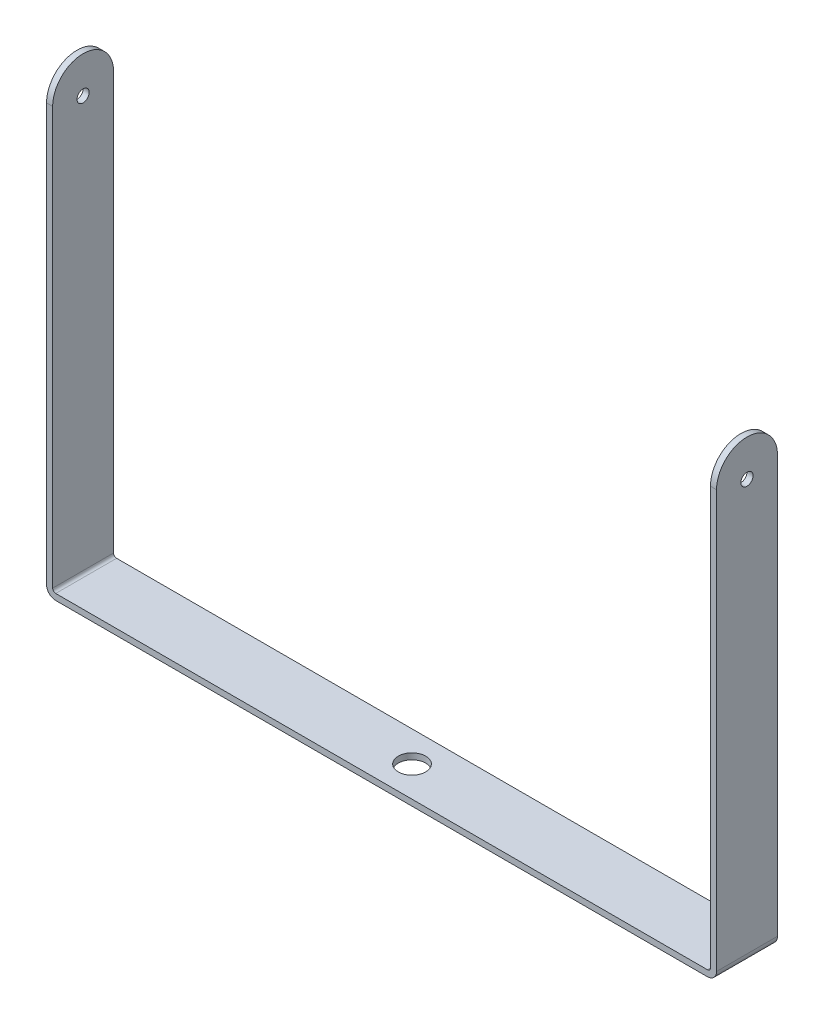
ISO-10303-21;
HEADER;
FILE_DESCRIPTION(('STEP AP214'),'2;1');
FILE_NAME('part.step','',(''),(''),'','','');
FILE_SCHEMA(('AUTOMOTIVE_DESIGN { 1 0 10303 214 1 1 1 1 }'));
ENDSEC;
DATA;
#1=APPLICATION_CONTEXT('core data for automotive mechanical design processes');
#2=APPLICATION_PROTOCOL_DEFINITION('international standard','automotive_design',2000,#1);
#3=PRODUCT_CONTEXT('',#1,'mechanical');
#4=PRODUCT('Part','Part','',(#3));
#5=PRODUCT_RELATED_PRODUCT_CATEGORY('part','',(#4));
#6=PRODUCT_DEFINITION_FORMATION('','',#4);
#7=PRODUCT_DEFINITION_CONTEXT('part definition',#1,'design');
#8=PRODUCT_DEFINITION('design','',#6,#7);
#9=PRODUCT_DEFINITION_SHAPE('','',#8);
#10=(LENGTH_UNIT() NAMED_UNIT(*) SI_UNIT(.MILLI.,.METRE.));
#11=(NAMED_UNIT(*) PLANE_ANGLE_UNIT() SI_UNIT($,.RADIAN.));
#12=(NAMED_UNIT(*) SI_UNIT($,.STERADIAN.) SOLID_ANGLE_UNIT());
#13=UNCERTAINTY_MEASURE_WITH_UNIT(LENGTH_MEASURE(1.E-05),#10,'distance_accuracy_value','');
#14=(GEOMETRIC_REPRESENTATION_CONTEXT(3) GLOBAL_UNCERTAINTY_ASSIGNED_CONTEXT((#13)) GLOBAL_UNIT_ASSIGNED_CONTEXT((#10,
#11,#12)) REPRESENTATION_CONTEXT('',''));
#15=CARTESIAN_POINT('',(0.,0.,0.));
#16=DIRECTION('',(0.,0.,1.));
#17=DIRECTION('',(1.,0.,0.));
#18=AXIS2_PLACEMENT_3D('',#15,#16,#17);
#19=CARTESIAN_POINT('',(-110.,2.,10.));
#20=DIRECTION('',(1.,0.,0.));
#21=DIRECTION('',(0.,1.,0.));
#22=AXIS2_PLACEMENT_3D('',#19,#20,#21);
#23=PLANE('',#22);
#24=CARTESIAN_POINT('',(-110.,0.,0.));
#25=DIRECTION('',(-1.,0.,0.));
#26=DIRECTION('',(0.,-1.,0.));
#27=AXIS2_PLACEMENT_3D('',#24,#25,#26);
#28=CIRCLE('',#27,2.);
#29=CARTESIAN_POINT('',(-110.,-2.00000000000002,0.));
#30=VERTEX_POINT('',#29);
#31=EDGE_CURVE('E316',#30,#30,#28,.T.);
#32=ORIENTED_EDGE('',*,*,#31,.F.);
#33=EDGE_LOOP('',(#32));
#34=FACE_BOUND('',#33,.T.);
#35=DIRECTION('',(0.,-1.,0.));
#36=VECTOR('',#35,1.);
#37=CARTESIAN_POINT('',(-110.,2.,-10.));
#38=LINE('',#37,#36);
#39=CARTESIAN_POINT('',(-110.,2.,-10.));
#40=VERTEX_POINT('',#39);
#41=CARTESIAN_POINT('',(-110.,-135.,-10.));
#42=VERTEX_POINT('',#41);
#43=EDGE_CURVE('E122',#40,#42,#38,.T.);
#44=ORIENTED_EDGE('',*,*,#43,.T.);
#45=DIRECTION('',(0.,0.,-1.));
#46=VECTOR('',#45,1.);
#47=CARTESIAN_POINT('',(-110.,-135.,10.));
#48=LINE('',#47,#46);
#49=CARTESIAN_POINT('',(-110.,-135.,10.));
#50=VERTEX_POINT('',#49);
#51=EDGE_CURVE('E11',#50,#42,#48,.T.);
#52=ORIENTED_EDGE('',*,*,#51,.F.);
#53=DIRECTION('',(0.,-1.,0.));
#54=VECTOR('',#53,1.);
#55=CARTESIAN_POINT('',(-110.,2.,10.));
#56=LINE('',#55,#54);
#57=CARTESIAN_POINT('',(-110.,2.,10.));
#58=VERTEX_POINT('',#57);
#59=EDGE_CURVE('E142',#58,#50,#56,.T.);
#60=ORIENTED_EDGE('',*,*,#59,.F.);
#61=CARTESIAN_POINT('',(-110.,2.,0.));
#62=DIRECTION('',(1.,0.,0.));
#63=DIRECTION('',(0.,0.,-1.));
#64=AXIS2_PLACEMENT_3D('',#61,#62,#63);
#65=CIRCLE('',#64,10.);
#66=EDGE_CURVE('E138',#40,#58,#65,.T.);
#67=ORIENTED_EDGE('',*,*,#66,.F.);
#68=EDGE_LOOP('',(#44,#52,#60,#67));
#69=FACE_BOUND('',#68,.T.);
#70=ADVANCED_FACE('F33',(#34,#69),#23,.F.);
#71=CARTESIAN_POINT('',(-107.,-135.,10.));
#72=DIRECTION('',(0.,0.,-1.));
#73=DIRECTION('',(-1.,0.,0.));
#74=AXIS2_PLACEMENT_3D('',#71,#72,#73);
#75=CYLINDRICAL_SURFACE('',#74,3.);
#76=CARTESIAN_POINT('',(-107.,-135.,-10.));
#77=DIRECTION('',(0.,0.,1.));
#78=DIRECTION('',(1.,0.,0.));
#79=AXIS2_PLACEMENT_3D('',#76,#77,#78);
#80=CIRCLE('',#79,3.);
#81=CARTESIAN_POINT('',(-107.,-138.,-10.));
#82=VERTEX_POINT('',#81);
#83=EDGE_CURVE('E129',#42,#82,#80,.T.);
#84=ORIENTED_EDGE('',*,*,#83,.T.);
#85=DIRECTION('',(0.,0.,-1.));
#86=VECTOR('',#85,1.);
#87=CARTESIAN_POINT('',(-107.,-138.,10.));
#88=LINE('',#87,#86);
#89=CARTESIAN_POINT('',(-107.,-138.,10.));
#90=VERTEX_POINT('',#89);
#91=EDGE_CURVE('E41',#90,#82,#88,.T.);
#92=ORIENTED_EDGE('',*,*,#91,.F.);
#93=CARTESIAN_POINT('',(-107.,-135.,10.));
#94=DIRECTION('',(0.,0.,1.));
#95=DIRECTION('',(1.,0.,0.));
#96=AXIS2_PLACEMENT_3D('',#93,#94,#95);
#97=CIRCLE('',#96,3.);
#98=EDGE_CURVE('E184',#50,#90,#97,.T.);
#99=ORIENTED_EDGE('',*,*,#98,.F.);
#100=ORIENTED_EDGE('',*,*,#51,.T.);
#101=EDGE_LOOP('',(#84,#92,#99,#100));
#102=FACE_BOUND('',#101,.T.);
#103=ADVANCED_FACE('F263',(#102),#75,.T.);
#104=CARTESIAN_POINT('',(-107.,-138.,10.));
#105=DIRECTION('',(0.,1.,0.));
#106=DIRECTION('',(0.,0.,1.));
#107=AXIS2_PLACEMENT_3D('',#104,#105,#106);
#108=PLANE('',#107);
#109=CARTESIAN_POINT('',(0.,-138.,0.));
#110=DIRECTION('',(0.,1.,0.));
#111=DIRECTION('',(0.,0.,1.));
#112=AXIS2_PLACEMENT_3D('',#109,#110,#111);
#113=CIRCLE('',#112,4.5);
#114=CARTESIAN_POINT('',(0.,-138.,4.5));
#115=VERTEX_POINT('',#114);
#116=EDGE_CURVE('E140',#115,#115,#113,.T.);
#117=ORIENTED_EDGE('',*,*,#116,.T.);
#118=EDGE_LOOP('',(#117));
#119=FACE_BOUND('',#118,.T.);
#120=DIRECTION('',(1.,0.,0.));
#121=VECTOR('',#120,1.);
#122=CARTESIAN_POINT('',(-107.,-138.,-10.));
#123=LINE('',#122,#121);
#124=CARTESIAN_POINT('',(107.,-138.,-10.));
#125=VERTEX_POINT('',#124);
#126=EDGE_CURVE('E162',#82,#125,#123,.T.);
#127=ORIENTED_EDGE('',*,*,#126,.T.);
#128=DIRECTION('',(0.,0.,-1.));
#129=VECTOR('',#128,1.);
#130=CARTESIAN_POINT('',(107.,-138.,10.));
#131=LINE('',#130,#129);
#132=CARTESIAN_POINT('',(107.,-138.,10.));
#133=VERTEX_POINT('',#132);
#134=EDGE_CURVE('E217',#133,#125,#131,.T.);
#135=ORIENTED_EDGE('',*,*,#134,.F.);
#136=DIRECTION('',(1.,0.,0.));
#137=VECTOR('',#136,1.);
#138=CARTESIAN_POINT('',(-107.,-138.,10.));
#139=LINE('',#138,#137);
#140=EDGE_CURVE('E186',#90,#133,#139,.T.);
#141=ORIENTED_EDGE('',*,*,#140,.F.);
#142=ORIENTED_EDGE('',*,*,#91,.T.);
#143=EDGE_LOOP('',(#127,#135,#141,#142));
#144=FACE_BOUND('',#143,.T.);
#145=ADVANCED_FACE('F224',(#119,#144),#108,.F.);
#146=CARTESIAN_POINT('',(107.,-135.,10.));
#147=DIRECTION('',(0.,0.,-1.));
#148=DIRECTION('',(-1.,0.,0.));
#149=AXIS2_PLACEMENT_3D('',#146,#147,#148);
#150=CYLINDRICAL_SURFACE('',#149,3.);
#151=CARTESIAN_POINT('',(107.,-135.,-10.));
#152=DIRECTION('',(0.,0.,1.));
#153=DIRECTION('',(1.,0.,0.));
#154=AXIS2_PLACEMENT_3D('',#151,#152,#153);
#155=CIRCLE('',#154,3.);
#156=CARTESIAN_POINT('',(110.,-135.,-10.));
#157=VERTEX_POINT('',#156);
#158=EDGE_CURVE('E164',#125,#157,#155,.T.);
#159=ORIENTED_EDGE('',*,*,#158,.T.);
#160=DIRECTION('',(0.,0.,-1.));
#161=VECTOR('',#160,1.);
#162=CARTESIAN_POINT('',(110.,-135.,10.));
#163=LINE('',#162,#161);
#164=CARTESIAN_POINT('',(110.,-135.,10.));
#165=VERTEX_POINT('',#164);
#166=EDGE_CURVE('E214',#165,#157,#163,.T.);
#167=ORIENTED_EDGE('',*,*,#166,.F.);
#168=CARTESIAN_POINT('',(107.,-135.,10.));
#169=DIRECTION('',(0.,0.,1.));
#170=DIRECTION('',(1.,0.,0.));
#171=AXIS2_PLACEMENT_3D('',#168,#169,#170);
#172=CIRCLE('',#171,3.);
#173=EDGE_CURVE('E188',#133,#165,#172,.T.);
#174=ORIENTED_EDGE('',*,*,#173,.F.);
#175=ORIENTED_EDGE('',*,*,#134,.T.);
#176=EDGE_LOOP('',(#159,#167,#174,#175));
#177=FACE_BOUND('',#176,.T.);
#178=ADVANCED_FACE('F233',(#177),#150,.T.);
#179=CARTESIAN_POINT('',(110.,-135.,10.));
#180=DIRECTION('',(-1.,0.,0.));
#181=DIRECTION('',(0.,0.,1.));
#182=AXIS2_PLACEMENT_3D('',#179,#180,#181);
#183=PLANE('',#182);
#184=CARTESIAN_POINT('',(110.,0.,0.));
#185=DIRECTION('',(-1.,0.,0.));
#186=DIRECTION('',(0.,-1.,0.));
#187=AXIS2_PLACEMENT_3D('',#184,#185,#186);
#188=CIRCLE('',#187,2.);
#189=CARTESIAN_POINT('',(110.,-1.99999999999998,0.));
#190=VERTEX_POINT('',#189);
#191=EDGE_CURVE('E314',#190,#190,#188,.T.);
#192=ORIENTED_EDGE('',*,*,#191,.T.);
#193=EDGE_LOOP('',(#192));
#194=FACE_BOUND('',#193,.T.);
#195=DIRECTION('',(0.,1.,0.));
#196=VECTOR('',#195,1.);
#197=CARTESIAN_POINT('',(110.,-135.,-10.));
#198=LINE('',#197,#196);
#199=CARTESIAN_POINT('',(110.,2.,-10.));
#200=VERTEX_POINT('',#199);
#201=EDGE_CURVE('E166',#157,#200,#198,.T.);
#202=ORIENTED_EDGE('',*,*,#201,.T.);
#203=CARTESIAN_POINT('',(110.,2.,0.));
#204=DIRECTION('',(1.,0.,0.));
#205=DIRECTION('',(0.,0.,-1.));
#206=AXIS2_PLACEMENT_3D('',#203,#204,#205);
#207=CIRCLE('',#206,10.);
#208=CARTESIAN_POINT('',(110.,2.,10.));
#209=VERTEX_POINT('',#208);
#210=EDGE_CURVE('E145',#200,#209,#207,.T.);
#211=ORIENTED_EDGE('',*,*,#210,.T.);
#212=DIRECTION('',(0.,1.,0.));
#213=VECTOR('',#212,1.);
#214=CARTESIAN_POINT('',(110.,-135.,10.));
#215=LINE('',#214,#213);
#216=EDGE_CURVE('E190',#165,#209,#215,.T.);
#217=ORIENTED_EDGE('',*,*,#216,.F.);
#218=ORIENTED_EDGE('',*,*,#166,.T.);
#219=EDGE_LOOP('',(#202,#211,#217,#218));
#220=FACE_BOUND('',#219,.T.);
#221=ADVANCED_FACE('F237',(#194,#220),#183,.F.);
#222=CARTESIAN_POINT('',(108.,-135.,10.));
#223=DIRECTION('',(1.,0.,0.));
#224=DIRECTION('',(0.,0.,-1.));
#225=AXIS2_PLACEMENT_3D('',#222,#223,#224);
#226=PLANE('',#225);
#227=CARTESIAN_POINT('',(108.,0.,0.));
#228=DIRECTION('',(1.,0.,0.));
#229=DIRECTION('',(0.,0.,-1.));
#230=AXIS2_PLACEMENT_3D('',#227,#228,#229);
#231=CIRCLE('',#230,2.);
#232=CARTESIAN_POINT('',(108.,0.,-2.));
#233=VERTEX_POINT('',#232);
#234=EDGE_CURVE('E143',#233,#233,#231,.T.);
#235=ORIENTED_EDGE('',*,*,#234,.T.);
#236=EDGE_LOOP('',(#235));
#237=FACE_BOUND('',#236,.T.);
#238=DIRECTION('',(0.,-1.,0.));
#239=VECTOR('',#238,1.);
#240=CARTESIAN_POINT('',(108.,-135.,-10.));
#241=LINE('',#240,#239);
#242=CARTESIAN_POINT('',(108.,2.,-10.));
#243=VERTEX_POINT('',#242);
#244=CARTESIAN_POINT('',(108.,-135.,-10.));
#245=VERTEX_POINT('',#244);
#246=EDGE_CURVE('E171',#243,#245,#241,.T.);
#247=ORIENTED_EDGE('',*,*,#246,.T.);
#248=DIRECTION('',(0.,0.,-1.));
#249=VECTOR('',#248,1.);
#250=CARTESIAN_POINT('',(108.,-135.,10.));
#251=LINE('',#250,#249);
#252=CARTESIAN_POINT('',(108.,-135.,10.));
#253=VERTEX_POINT('',#252);
#254=EDGE_CURVE('E211',#253,#245,#251,.T.);
#255=ORIENTED_EDGE('',*,*,#254,.F.);
#256=DIRECTION('',(0.,-1.,0.));
#257=VECTOR('',#256,1.);
#258=CARTESIAN_POINT('',(108.,-135.,10.));
#259=LINE('',#258,#257);
#260=CARTESIAN_POINT('',(108.,2.,10.));
#261=VERTEX_POINT('',#260);
#262=EDGE_CURVE('E194',#261,#253,#259,.T.);
#263=ORIENTED_EDGE('',*,*,#262,.F.);
#264=CARTESIAN_POINT('',(108.,2.,0.));
#265=DIRECTION('',(1.,0.,0.));
#266=DIRECTION('',(0.,0.,-1.));
#267=AXIS2_PLACEMENT_3D('',#264,#265,#266);
#268=CIRCLE('',#267,10.);
#269=EDGE_CURVE('E153',#243,#261,#268,.T.);
#270=ORIENTED_EDGE('',*,*,#269,.F.);
#271=EDGE_LOOP('',(#247,#255,#263,#270));
#272=FACE_BOUND('',#271,.T.);
#273=ADVANCED_FACE('F246',(#237,#272),#226,.F.);
#274=CARTESIAN_POINT('',(107.,-135.,10.));
#275=DIRECTION('',(0.,0.,-1.));
#276=DIRECTION('',(-1.,0.,0.));
#277=AXIS2_PLACEMENT_3D('',#274,#275,#276);
#278=CYLINDRICAL_SURFACE('',#277,1.);
#279=CARTESIAN_POINT('',(107.,-135.,-10.));
#280=DIRECTION('',(0.,0.,-1.));
#281=DIRECTION('',(1.,0.,0.));
#282=AXIS2_PLACEMENT_3D('',#279,#280,#281);
#283=CIRCLE('',#282,1.);
#284=CARTESIAN_POINT('',(107.,-136.,-10.));
#285=VERTEX_POINT('',#284);
#286=EDGE_CURVE('E173',#245,#285,#283,.T.);
#287=ORIENTED_EDGE('',*,*,#286,.T.);
#288=DIRECTION('',(0.,0.,-1.));
#289=VECTOR('',#288,1.);
#290=CARTESIAN_POINT('',(107.,-136.,10.));
#291=LINE('',#290,#289);
#292=CARTESIAN_POINT('',(107.,-136.,10.));
#293=VERTEX_POINT('',#292);
#294=EDGE_CURVE('E208',#293,#285,#291,.T.);
#295=ORIENTED_EDGE('',*,*,#294,.F.);
#296=CARTESIAN_POINT('',(107.,-135.,10.));
#297=DIRECTION('',(0.,0.,-1.));
#298=DIRECTION('',(1.,0.,0.));
#299=AXIS2_PLACEMENT_3D('',#296,#297,#298);
#300=CIRCLE('',#299,1.);
#301=EDGE_CURVE('E196',#253,#293,#300,.T.);
#302=ORIENTED_EDGE('',*,*,#301,.F.);
#303=ORIENTED_EDGE('',*,*,#254,.T.);
#304=EDGE_LOOP('',(#287,#295,#302,#303));
#305=FACE_BOUND('',#304,.T.);
#306=ADVANCED_FACE('F253',(#305),#278,.F.);
#307=CARTESIAN_POINT('',(-107.,-136.,10.));
#308=DIRECTION('',(0.,-1.,0.));
#309=DIRECTION('',(0.,0.,-1.));
#310=AXIS2_PLACEMENT_3D('',#307,#308,#309);
#311=PLANE('',#310);
#312=CARTESIAN_POINT('',(0.,-136.,0.));
#313=DIRECTION('',(0.,1.,0.));
#314=DIRECTION('',(0.,0.,1.));
#315=AXIS2_PLACEMENT_3D('',#312,#313,#314);
#316=CIRCLE('',#315,4.5);
#317=CARTESIAN_POINT('',(0.,-136.,4.5));
#318=VERTEX_POINT('',#317);
#319=EDGE_CURVE('E156',#318,#318,#316,.T.);
#320=ORIENTED_EDGE('',*,*,#319,.F.);
#321=EDGE_LOOP('',(#320));
#322=FACE_BOUND('',#321,.T.);
#323=DIRECTION('',(-1.,0.,0.));
#324=VECTOR('',#323,1.);
#325=CARTESIAN_POINT('',(-107.,-136.,-10.));
#326=LINE('',#325,#324);
#327=CARTESIAN_POINT('',(-107.,-136.,-10.));
#328=VERTEX_POINT('',#327);
#329=EDGE_CURVE('E175',#285,#328,#326,.T.);
#330=ORIENTED_EDGE('',*,*,#329,.T.);
#331=DIRECTION('',(0.,0.,-1.));
#332=VECTOR('',#331,1.);
#333=CARTESIAN_POINT('',(-107.,-136.,10.));
#334=LINE('',#333,#332);
#335=CARTESIAN_POINT('',(-107.,-136.,10.));
#336=VERTEX_POINT('',#335);
#337=EDGE_CURVE('E205',#336,#328,#334,.T.);
#338=ORIENTED_EDGE('',*,*,#337,.F.);
#339=DIRECTION('',(-1.,0.,0.));
#340=VECTOR('',#339,1.);
#341=CARTESIAN_POINT('',(-107.,-136.,10.));
#342=LINE('',#341,#340);
#343=EDGE_CURVE('E198',#293,#336,#342,.T.);
#344=ORIENTED_EDGE('',*,*,#343,.F.);
#345=ORIENTED_EDGE('',*,*,#294,.T.);
#346=EDGE_LOOP('',(#330,#338,#344,#345));
#347=FACE_BOUND('',#346,.T.);
#348=ADVANCED_FACE('F257',(#322,#347),#311,.F.);
#349=CARTESIAN_POINT('',(-107.,-135.,10.));
#350=DIRECTION('',(0.,0.,-1.));
#351=DIRECTION('',(-1.,0.,0.));
#352=AXIS2_PLACEMENT_3D('',#349,#350,#351);
#353=CYLINDRICAL_SURFACE('',#352,1.);
#354=CARTESIAN_POINT('',(-107.,-135.,-10.));
#355=DIRECTION('',(0.,0.,-1.));
#356=DIRECTION('',(1.,0.,0.));
#357=AXIS2_PLACEMENT_3D('',#354,#355,#356);
#358=CIRCLE('',#357,1.);
#359=CARTESIAN_POINT('',(-108.,-135.,-10.));
#360=VERTEX_POINT('',#359);
#361=EDGE_CURVE('E177',#328,#360,#358,.T.);
#362=ORIENTED_EDGE('',*,*,#361,.T.);
#363=DIRECTION('',(0.,0.,-1.));
#364=VECTOR('',#363,1.);
#365=CARTESIAN_POINT('',(-108.,-135.,10.));
#366=LINE('',#365,#364);
#367=CARTESIAN_POINT('',(-108.,-135.,10.));
#368=VERTEX_POINT('',#367);
#369=EDGE_CURVE('E202',#368,#360,#366,.T.);
#370=ORIENTED_EDGE('',*,*,#369,.F.);
#371=CARTESIAN_POINT('',(-107.,-135.,10.));
#372=DIRECTION('',(0.,0.,-1.));
#373=DIRECTION('',(1.,0.,0.));
#374=AXIS2_PLACEMENT_3D('',#371,#372,#373);
#375=CIRCLE('',#374,1.);
#376=EDGE_CURVE('E53',#336,#368,#375,.T.);
#377=ORIENTED_EDGE('',*,*,#376,.F.);
#378=ORIENTED_EDGE('',*,*,#337,.T.);
#379=EDGE_LOOP('',(#362,#370,#377,#378));
#380=FACE_BOUND('',#379,.T.);
#381=ADVANCED_FACE('F260',(#380),#353,.F.);
#382=CARTESIAN_POINT('',(-108.,2.,10.));
#383=DIRECTION('',(-1.,0.,0.));
#384=DIRECTION('',(0.,0.,1.));
#385=AXIS2_PLACEMENT_3D('',#382,#383,#384);
#386=PLANE('',#385);
#387=CARTESIAN_POINT('',(-108.,0.,0.));
#388=DIRECTION('',(-1.,0.,0.));
#389=DIRECTION('',(0.,0.,1.));
#390=AXIS2_PLACEMENT_3D('',#387,#388,#389);
#391=CIRCLE('',#390,2.);
#392=CARTESIAN_POINT('',(-108.,0.,2.));
#393=VERTEX_POINT('',#392);
#394=EDGE_CURVE('E36',#393,#393,#391,.T.);
#395=ORIENTED_EDGE('',*,*,#394,.T.);
#396=EDGE_LOOP('',(#395));
#397=FACE_BOUND('',#396,.T.);
#398=DIRECTION('',(0.,1.,0.));
#399=VECTOR('',#398,1.);
#400=CARTESIAN_POINT('',(-108.,2.,-10.));
#401=LINE('',#400,#399);
#402=CARTESIAN_POINT('',(-108.,2.,-10.));
#403=VERTEX_POINT('',#402);
#404=EDGE_CURVE('E179',#360,#403,#401,.T.);
#405=ORIENTED_EDGE('',*,*,#404,.T.);
#406=CARTESIAN_POINT('',(-108.,2.,0.));
#407=DIRECTION('',(1.,0.,0.));
#408=DIRECTION('',(0.,0.,-1.));
#409=AXIS2_PLACEMENT_3D('',#406,#407,#408);
#410=CIRCLE('',#409,10.);
#411=CARTESIAN_POINT('',(-108.,2.,10.));
#412=VERTEX_POINT('',#411);
#413=EDGE_CURVE('E139',#403,#412,#410,.T.);
#414=ORIENTED_EDGE('',*,*,#413,.T.);
#415=DIRECTION('',(0.,1.,0.));
#416=VECTOR('',#415,1.);
#417=CARTESIAN_POINT('',(-108.,2.,10.));
#418=LINE('',#417,#416);
#419=EDGE_CURVE('E48',#368,#412,#418,.T.);
#420=ORIENTED_EDGE('',*,*,#419,.F.);
#421=ORIENTED_EDGE('',*,*,#369,.T.);
#422=EDGE_LOOP('',(#405,#414,#420,#421));
#423=FACE_BOUND('',#422,.T.);
#424=ADVANCED_FACE('F262',(#397,#423),#386,.F.);
#425=CARTESIAN_POINT('',(-107.,-135.,10.));
#426=DIRECTION('',(0.,0.,1.));
#427=DIRECTION('',(1.,0.,0.));
#428=AXIS2_PLACEMENT_3D('',#425,#426,#427);
#429=PLANE('',#428);
#430=DIRECTION('',(-1.,0.,0.));
#431=VECTOR('',#430,1.);
#432=CARTESIAN_POINT('',(-110.,2.,10.));
#433=LINE('',#432,#431);
#434=EDGE_CURVE('E181',#412,#58,#433,.T.);
#435=ORIENTED_EDGE('',*,*,#434,.T.);
#436=ORIENTED_EDGE('',*,*,#59,.T.);
#437=ORIENTED_EDGE('',*,*,#98,.T.);
#438=ORIENTED_EDGE('',*,*,#140,.T.);
#439=ORIENTED_EDGE('',*,*,#173,.T.);
#440=ORIENTED_EDGE('',*,*,#216,.T.);
#441=DIRECTION('',(-1.,0.,0.));
#442=VECTOR('',#441,1.);
#443=CARTESIAN_POINT('',(110.,2.,10.));
#444=LINE('',#443,#442);
#445=EDGE_CURVE('E192',#209,#261,#444,.T.);
#446=ORIENTED_EDGE('',*,*,#445,.T.);
#447=ORIENTED_EDGE('',*,*,#262,.T.);
#448=ORIENTED_EDGE('',*,*,#301,.T.);
#449=ORIENTED_EDGE('',*,*,#343,.T.);
#450=ORIENTED_EDGE('',*,*,#376,.T.);
#451=ORIENTED_EDGE('',*,*,#419,.T.);
#452=EDGE_LOOP('',(#435,#436,#437,#438,#439,#440,#446,#447,#448,#449,#450,#451));
#453=FACE_BOUND('',#452,.T.);
#454=ADVANCED_FACE('F240',(#453),#429,.T.);
#455=CARTESIAN_POINT('',(-107.,-135.,-10.));
#456=DIRECTION('',(0.,0.,1.));
#457=DIRECTION('',(1.,0.,0.));
#458=AXIS2_PLACEMENT_3D('',#455,#456,#457);
#459=PLANE('',#458);
#460=DIRECTION('',(-1.,0.,0.));
#461=VECTOR('',#460,1.);
#462=CARTESIAN_POINT('',(-110.,2.,-10.));
#463=LINE('',#462,#461);
#464=EDGE_CURVE('E126',#403,#40,#463,.T.);
#465=ORIENTED_EDGE('',*,*,#464,.F.);
#466=ORIENTED_EDGE('',*,*,#404,.F.);
#467=ORIENTED_EDGE('',*,*,#361,.F.);
#468=ORIENTED_EDGE('',*,*,#329,.F.);
#469=ORIENTED_EDGE('',*,*,#286,.F.);
#470=ORIENTED_EDGE('',*,*,#246,.F.);
#471=DIRECTION('',(-1.,0.,0.));
#472=VECTOR('',#471,1.);
#473=CARTESIAN_POINT('',(110.,2.,-10.));
#474=LINE('',#473,#472);
#475=EDGE_CURVE('E168',#200,#243,#474,.T.);
#476=ORIENTED_EDGE('',*,*,#475,.F.);
#477=ORIENTED_EDGE('',*,*,#201,.F.);
#478=ORIENTED_EDGE('',*,*,#158,.F.);
#479=ORIENTED_EDGE('',*,*,#126,.F.);
#480=ORIENTED_EDGE('',*,*,#83,.F.);
#481=ORIENTED_EDGE('',*,*,#43,.F.);
#482=EDGE_LOOP('',(#465,#466,#467,#468,#469,#470,#476,#477,#478,#479,#480,#481));
#483=FACE_BOUND('',#482,.T.);
#484=ADVANCED_FACE('F124',(#483),#459,.F.);
#485=CARTESIAN_POINT('',(0.,-138.,0.));
#486=DIRECTION('',(0.,1.,0.));
#487=DIRECTION('',(0.,0.,1.));
#488=AXIS2_PLACEMENT_3D('',#485,#486,#487);
#489=CYLINDRICAL_SURFACE('',#488,4.5);
#490=ORIENTED_EDGE('',*,*,#116,.F.);
#491=EDGE_LOOP('',(#490));
#492=FACE_BOUND('',#491,.T.);
#493=ORIENTED_EDGE('',*,*,#319,.T.);
#494=EDGE_LOOP('',(#493));
#495=FACE_BOUND('',#494,.T.);
#496=ADVANCED_FACE('F295',(#492,#495),#489,.F.);
#497=CARTESIAN_POINT('',(108.,2.,0.));
#498=DIRECTION('',(1.,0.,0.));
#499=DIRECTION('',(0.,0.,-1.));
#500=AXIS2_PLACEMENT_3D('',#497,#498,#499);
#501=CYLINDRICAL_SURFACE('',#500,10.);
#502=ORIENTED_EDGE('',*,*,#210,.F.);
#503=ORIENTED_EDGE('',*,*,#475,.T.);
#504=ORIENTED_EDGE('',*,*,#269,.T.);
#505=ORIENTED_EDGE('',*,*,#445,.F.);
#506=EDGE_LOOP('',(#502,#503,#504,#505));
#507=FACE_BOUND('',#506,.T.);
#508=ADVANCED_FACE('F243',(#507),#501,.T.);
#509=CARTESIAN_POINT('',(-108.,2.,0.));
#510=DIRECTION('',(-1.,0.,0.));
#511=DIRECTION('',(0.,0.,1.));
#512=AXIS2_PLACEMENT_3D('',#509,#510,#511);
#513=CYLINDRICAL_SURFACE('',#512,10.);
#514=ORIENTED_EDGE('',*,*,#66,.T.);
#515=ORIENTED_EDGE('',*,*,#434,.F.);
#516=ORIENTED_EDGE('',*,*,#413,.F.);
#517=ORIENTED_EDGE('',*,*,#464,.T.);
#518=EDGE_LOOP('',(#514,#515,#516,#517));
#519=FACE_BOUND('',#518,.T.);
#520=ADVANCED_FACE('F136',(#519),#513,.T.);
#521=CARTESIAN_POINT('',(110.,0.,0.));
#522=DIRECTION('',(-1.,0.,0.));
#523=DIRECTION('',(0.,-1.,0.));
#524=AXIS2_PLACEMENT_3D('',#521,#522,#523);
#525=CYLINDRICAL_SURFACE('',#524,2.);
#526=ORIENTED_EDGE('',*,*,#31,.T.);
#527=EDGE_LOOP('',(#526));
#528=FACE_BOUND('',#527,.T.);
#529=ORIENTED_EDGE('',*,*,#394,.F.);
#530=EDGE_LOOP('',(#529));
#531=FACE_BOUND('',#530,.T.);
#532=ADVANCED_FACE('F303',(#528,#531),#525,.F.);
#533=ORIENTED_EDGE('',*,*,#191,.F.);
#534=EDGE_LOOP('',(#533));
#535=FACE_BOUND('',#534,.T.);
#536=ORIENTED_EDGE('',*,*,#234,.F.);
#537=EDGE_LOOP('',(#536));
#538=FACE_BOUND('',#537,.T.);
#539=ADVANCED_FACE('F304',(#535,#538),#525,.F.);
#540=CLOSED_SHELL('',(#70,#103,#145,#178,#221,#273,#306,#348,#381,#424,#454,#484,#496,#508,#520,
#532,#539));
#541=MANIFOLD_SOLID_BREP('B2',#540);
#542=ADVANCED_BREP_SHAPE_REPRESENTATION('',(#18,#541),#14);
#543=SHAPE_DEFINITION_REPRESENTATION(#9,#542);
ENDSEC;
END-ISO-10303-21;
